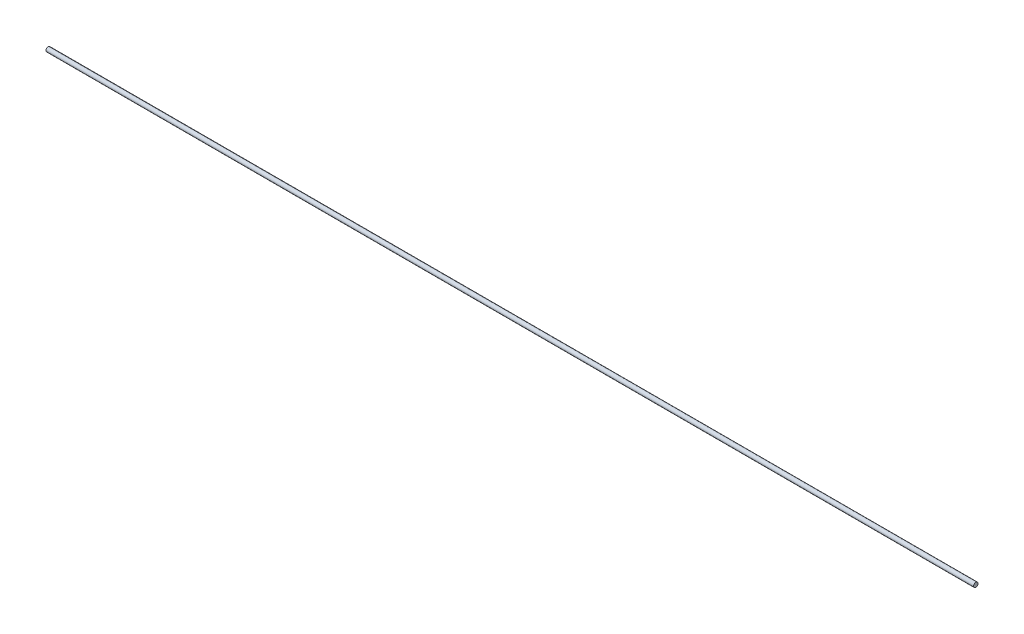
from build123d import *

# Parameters (mm, degrees)
SKETCH1_R             = 14.3256
N9_1_128IN_20FT_DEPTH = 2996.55


with BuildPart() as part:
    # Sketch1 → N9 - 1.128in - 20ft (new, symmetric)
    with BuildSketch(Plane.YZ):
        with Locations(Location((0, 0, 0), (0, 0, 270))):
            Circle(SKETCH1_R)
    extrude(amount=N9_1_128IN_20FT_DEPTH, both=True)


solid = part.part
